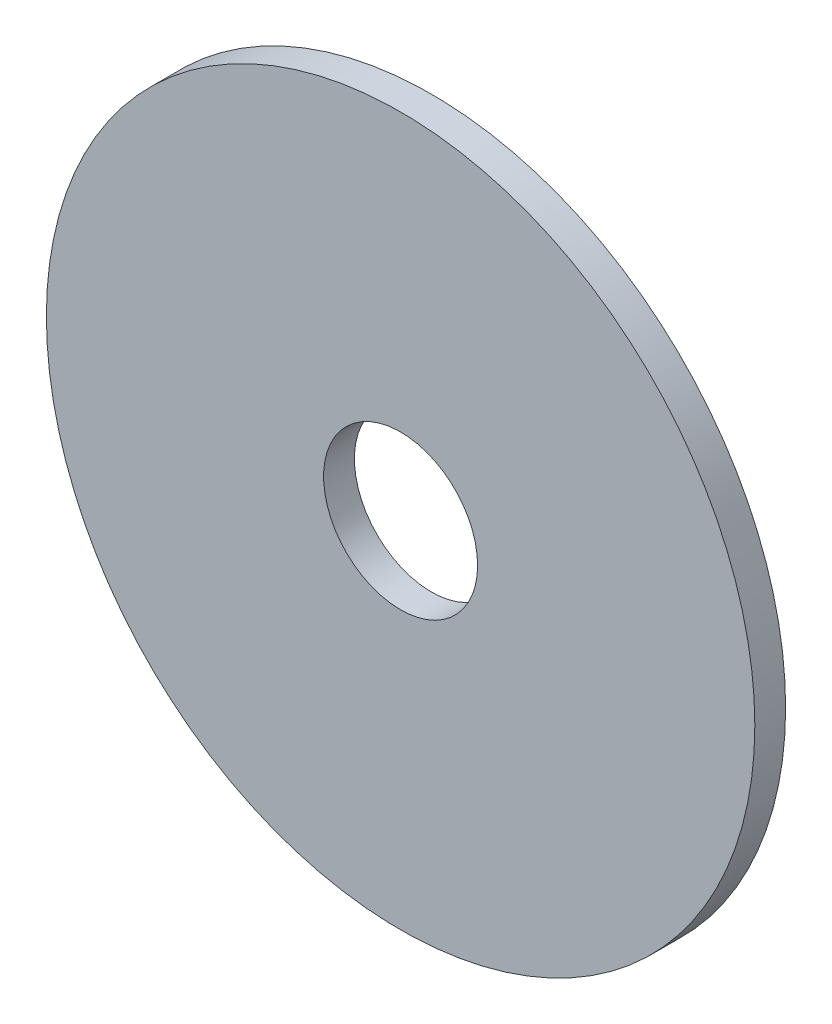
ISO-10303-21;
HEADER;
FILE_DESCRIPTION(('STEP AP214'),'2;1');
FILE_NAME('part.step','',(''),(''),'','','');
FILE_SCHEMA(('AUTOMOTIVE_DESIGN { 1 0 10303 214 1 1 1 1 }'));
ENDSEC;
DATA;
#1=APPLICATION_CONTEXT('core data for automotive mechanical design processes');
#2=APPLICATION_PROTOCOL_DEFINITION('international standard','automotive_design',2000,#1);
#3=PRODUCT_CONTEXT('',#1,'mechanical');
#4=PRODUCT('Part','Part','',(#3));
#5=PRODUCT_RELATED_PRODUCT_CATEGORY('part','',(#4));
#6=PRODUCT_DEFINITION_FORMATION('','',#4);
#7=PRODUCT_DEFINITION_CONTEXT('part definition',#1,'design');
#8=PRODUCT_DEFINITION('design','',#6,#7);
#9=PRODUCT_DEFINITION_SHAPE('','',#8);
#10=(LENGTH_UNIT() NAMED_UNIT(*) SI_UNIT(.MILLI.,.METRE.));
#11=(NAMED_UNIT(*) PLANE_ANGLE_UNIT() SI_UNIT($,.RADIAN.));
#12=(NAMED_UNIT(*) SI_UNIT($,.STERADIAN.) SOLID_ANGLE_UNIT());
#13=UNCERTAINTY_MEASURE_WITH_UNIT(LENGTH_MEASURE(1.E-05),#10,'distance_accuracy_value','');
#14=(GEOMETRIC_REPRESENTATION_CONTEXT(3) GLOBAL_UNCERTAINTY_ASSIGNED_CONTEXT((#13)) GLOBAL_UNIT_ASSIGNED_CONTEXT((#10,
#11,#12)) REPRESENTATION_CONTEXT('',''));
#15=CARTESIAN_POINT('',(0.,0.,0.));
#16=DIRECTION('',(0.,0.,1.));
#17=DIRECTION('',(1.,0.,0.));
#18=AXIS2_PLACEMENT_3D('',#15,#16,#17);
#19=CARTESIAN_POINT('',(0.,0.,5.));
#20=DIRECTION('',(0.,0.,1.));
#21=DIRECTION('',(1.,0.,0.));
#22=AXIS2_PLACEMENT_3D('',#19,#20,#21);
#23=PLANE('',#22);
#24=CARTESIAN_POINT('',(0.,0.,5.));
#25=DIRECTION('',(0.,0.,1.));
#26=DIRECTION('',(1.,0.,0.));
#27=AXIS2_PLACEMENT_3D('',#24,#25,#26);
#28=CIRCLE('',#27,57.5);
#29=CARTESIAN_POINT('',(57.5,0.,5.));
#30=VERTEX_POINT('',#29);
#31=EDGE_CURVE('E10',#30,#30,#28,.T.);
#32=ORIENTED_EDGE('',*,*,#31,.T.);
#33=EDGE_LOOP('',(#32));
#34=FACE_BOUND('',#33,.T.);
#35=CARTESIAN_POINT('',(0.,0.,5.));
#36=DIRECTION('',(0.,0.,1.));
#37=DIRECTION('',(1.,0.,0.));
#38=AXIS2_PLACEMENT_3D('',#35,#36,#37);
#39=CIRCLE('',#38,12.5);
#40=CARTESIAN_POINT('',(12.5,0.,5.));
#41=VERTEX_POINT('',#40);
#42=EDGE_CURVE('E41',#41,#41,#39,.T.);
#43=ORIENTED_EDGE('',*,*,#42,.F.);
#44=EDGE_LOOP('',(#43));
#45=FACE_BOUND('',#44,.T.);
#46=ADVANCED_FACE('F30',(#34,#45),#23,.T.);
#47=CARTESIAN_POINT('',(0.,0.,0.));
#48=DIRECTION('',(0.,0.,1.));
#49=DIRECTION('',(1.,0.,0.));
#50=AXIS2_PLACEMENT_3D('',#47,#48,#49);
#51=PLANE('',#50);
#52=CARTESIAN_POINT('',(0.,0.,0.));
#53=DIRECTION('',(0.,0.,1.));
#54=DIRECTION('',(1.,0.,0.));
#55=AXIS2_PLACEMENT_3D('',#52,#53,#54);
#56=CIRCLE('',#55,57.5);
#57=CARTESIAN_POINT('',(57.5,0.,0.));
#58=VERTEX_POINT('',#57);
#59=EDGE_CURVE('E34',#58,#58,#56,.T.);
#60=ORIENTED_EDGE('',*,*,#59,.F.);
#61=EDGE_LOOP('',(#60));
#62=FACE_BOUND('',#61,.T.);
#63=CARTESIAN_POINT('',(0.,0.,0.));
#64=DIRECTION('',(0.,0.,1.));
#65=DIRECTION('',(1.,0.,0.));
#66=AXIS2_PLACEMENT_3D('',#63,#64,#65);
#67=CIRCLE('',#66,12.5);
#68=CARTESIAN_POINT('',(12.5,0.,0.));
#69=VERTEX_POINT('',#68);
#70=EDGE_CURVE('E43',#69,#69,#67,.T.);
#71=ORIENTED_EDGE('',*,*,#70,.T.);
#72=EDGE_LOOP('',(#71));
#73=FACE_BOUND('',#72,.T.);
#74=ADVANCED_FACE('F53',(#62,#73),#51,.F.);
#75=CARTESIAN_POINT('',(0.,0.,5.));
#76=DIRECTION('',(0.,0.,-1.));
#77=DIRECTION('',(-1.,0.,0.));
#78=AXIS2_PLACEMENT_3D('',#75,#76,#77);
#79=CYLINDRICAL_SURFACE('',#78,57.5);
#80=ORIENTED_EDGE('',*,*,#31,.F.);
#81=EDGE_LOOP('',(#80));
#82=FACE_BOUND('',#81,.T.);
#83=ORIENTED_EDGE('',*,*,#59,.T.);
#84=EDGE_LOOP('',(#83));
#85=FACE_BOUND('',#84,.T.);
#86=ADVANCED_FACE('F32',(#82,#85),#79,.T.);
#87=CARTESIAN_POINT('',(0.,0.,5.));
#88=DIRECTION('',(0.,0.,-1.));
#89=DIRECTION('',(-1.,0.,0.));
#90=AXIS2_PLACEMENT_3D('',#87,#88,#89);
#91=CYLINDRICAL_SURFACE('',#90,12.5);
#92=ORIENTED_EDGE('',*,*,#42,.T.);
#93=EDGE_LOOP('',(#92));
#94=FACE_BOUND('',#93,.T.);
#95=ORIENTED_EDGE('',*,*,#70,.F.);
#96=EDGE_LOOP('',(#95));
#97=FACE_BOUND('',#96,.T.);
#98=ADVANCED_FACE('F49',(#94,#97),#91,.F.);
#99=CLOSED_SHELL('',(#46,#74,#86,#98));
#100=MANIFOLD_SOLID_BREP('B2',#99);
#101=ADVANCED_BREP_SHAPE_REPRESENTATION('',(#18,#100),#14);
#102=SHAPE_DEFINITION_REPRESENTATION(#9,#101);
ENDSEC;
END-ISO-10303-21;
